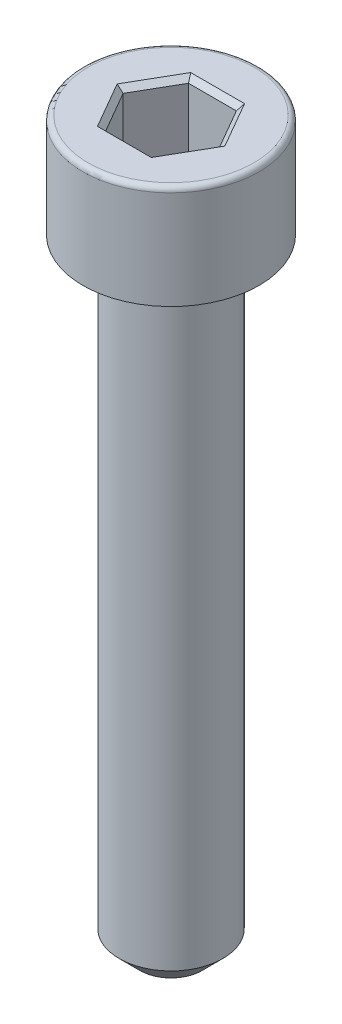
ISO-10303-21;
HEADER;
FILE_DESCRIPTION(('STEP AP214'),'2;1');
FILE_NAME('part.step','',(''),(''),'','','');
FILE_SCHEMA(('AUTOMOTIVE_DESIGN { 1 0 10303 214 1 1 1 1 }'));
ENDSEC;
DATA;
#1=APPLICATION_CONTEXT('core data for automotive mechanical design processes');
#2=APPLICATION_PROTOCOL_DEFINITION('international standard','automotive_design',2000,#1);
#3=PRODUCT_CONTEXT('',#1,'mechanical');
#4=PRODUCT('Part','Part','',(#3));
#5=PRODUCT_RELATED_PRODUCT_CATEGORY('part','',(#4));
#6=PRODUCT_DEFINITION_FORMATION('','',#4);
#7=PRODUCT_DEFINITION_CONTEXT('part definition',#1,'design');
#8=PRODUCT_DEFINITION('design','',#6,#7);
#9=PRODUCT_DEFINITION_SHAPE('','',#8);
#10=(LENGTH_UNIT() NAMED_UNIT(*) SI_UNIT(.MILLI.,.METRE.));
#11=(NAMED_UNIT(*) PLANE_ANGLE_UNIT() SI_UNIT($,.RADIAN.));
#12=(NAMED_UNIT(*) SI_UNIT($,.STERADIAN.) SOLID_ANGLE_UNIT());
#13=UNCERTAINTY_MEASURE_WITH_UNIT(LENGTH_MEASURE(1.E-05),#10,'distance_accuracy_value','');
#14=(GEOMETRIC_REPRESENTATION_CONTEXT(3) GLOBAL_UNCERTAINTY_ASSIGNED_CONTEXT((#13)) GLOBAL_UNIT_ASSIGNED_CONTEXT((#10,
#11,#12)) REPRESENTATION_CONTEXT('',''));
#15=CARTESIAN_POINT('',(0.,0.,0.));
#16=DIRECTION('',(0.,0.,1.));
#17=DIRECTION('',(1.,0.,0.));
#18=AXIS2_PLACEMENT_3D('',#15,#16,#17);
#19=CARTESIAN_POINT('',(32.8952994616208,38.75,7.5));
#20=DIRECTION('',(-0.612372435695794,-0.707106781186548,-0.353553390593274));
#21=DIRECTION('',(-0.5,0.,0.866025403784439));
#22=AXIS2_PLACEMENT_3D('',#19,#20,#21);
#23=PLANE('',#22);
#24=DIRECTION('',(-0.377964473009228,0.654653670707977,-0.654653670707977));
#25=VECTOR('',#24,1.);
#26=CARTESIAN_POINT('',(32.8952994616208,38.75,7.5));
#27=LINE('',#26,#25);
#28=CARTESIAN_POINT('',(32.8952994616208,38.75,7.5));
#29=VERTEX_POINT('',#28);
#30=CARTESIAN_POINT('',(32.7509618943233,39.,7.25));
#31=VERTEX_POINT('',#30);
#32=EDGE_CURVE('E24',#29,#31,#27,.T.);
#33=ORIENTED_EDGE('',*,*,#32,.T.);
#34=DIRECTION('',(0.5,0.,-0.866025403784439));
#35=VECTOR('',#34,1.);
#36=CARTESIAN_POINT('',(32.101442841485,39.,8.375));
#37=LINE('',#36,#35);
#38=CARTESIAN_POINT('',(31.4519237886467,39.,9.5));
#39=VERTEX_POINT('',#38);
#40=EDGE_CURVE('E224',#39,#31,#37,.T.);
#41=ORIENTED_EDGE('',*,*,#40,.F.);
#42=DIRECTION('',(0.755928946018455,-0.654653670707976,0.));
#43=VECTOR('',#42,1.);
#44=CARTESIAN_POINT('',(32.4004278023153,38.1785714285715,9.5));
#45=LINE('',#44,#43);
#46=CARTESIAN_POINT('',(31.7405989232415,38.75,9.5));
#47=VERTEX_POINT('',#46);
#48=EDGE_CURVE('E11',#39,#47,#45,.T.);
#49=ORIENTED_EDGE('',*,*,#48,.T.);
#50=DIRECTION('',(-0.5,0.,0.866025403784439));
#51=VECTOR('',#50,1.);
#52=CARTESIAN_POINT('',(32.8952994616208,38.75,7.5));
#53=LINE('',#52,#51);
#54=EDGE_CURVE('E255',#29,#47,#53,.T.);
#55=ORIENTED_EDGE('',*,*,#54,.F.);
#56=EDGE_LOOP('',(#33,#41,#49,#55));
#57=FACE_BOUND('',#56,.T.);
#58=ADVANCED_FACE('F16',(#57),#23,.F.);
#59=CARTESIAN_POINT('',(31.7405989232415,38.75,9.5));
#60=DIRECTION('',(-0.612372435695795,-0.707106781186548,0.353553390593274));
#61=DIRECTION('',(0.5,0.,0.866025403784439));
#62=AXIS2_PLACEMENT_3D('',#59,#60,#61);
#63=PLANE('',#62);
#64=DIRECTION('',(0.377964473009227,-0.654653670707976,-0.654653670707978));
#65=VECTOR('',#64,1.);
#66=CARTESIAN_POINT('',(32.8952994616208,38.75,11.5));
#67=LINE('',#66,#65);
#68=CARTESIAN_POINT('',(32.7509618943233,39.,11.75));
#69=VERTEX_POINT('',#68);
#70=CARTESIAN_POINT('',(32.8952994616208,38.75,11.5));
#71=VERTEX_POINT('',#70);
#72=EDGE_CURVE('E368',#69,#71,#67,.T.);
#73=ORIENTED_EDGE('',*,*,#72,.T.);
#74=DIRECTION('',(0.5,0.,0.866025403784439));
#75=VECTOR('',#74,1.);
#76=CARTESIAN_POINT('',(31.7405989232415,38.75,9.5));
#77=LINE('',#76,#75);
#78=EDGE_CURVE('E317',#47,#71,#77,.T.);
#79=ORIENTED_EDGE('',*,*,#78,.F.);
#80=ORIENTED_EDGE('',*,*,#48,.F.);
#81=DIRECTION('',(-0.5,0.,-0.866025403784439));
#82=VECTOR('',#81,1.);
#83=CARTESIAN_POINT('',(32.101442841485,39.,10.625));
#84=LINE('',#83,#82);
#85=EDGE_CURVE('E228',#69,#39,#84,.T.);
#86=ORIENTED_EDGE('',*,*,#85,.F.);
#87=EDGE_LOOP('',(#73,#79,#80,#86));
#88=FACE_BOUND('',#87,.T.);
#89=ADVANCED_FACE('F387',(#88),#63,.F.);
#90=CARTESIAN_POINT('',(35.2047005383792,38.75,7.5));
#91=DIRECTION('',(0.,-0.707106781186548,-0.707106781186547));
#92=DIRECTION('',(-1.,0.,0.));
#93=AXIS2_PLACEMENT_3D('',#90,#91,#92);
#94=PLANE('',#93);
#95=DIRECTION('',(0.377964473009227,0.654653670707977,-0.654653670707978));
#96=VECTOR('',#95,1.);
#97=CARTESIAN_POINT('',(35.2047005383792,38.75,7.5));
#98=LINE('',#97,#96);
#99=CARTESIAN_POINT('',(35.2047005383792,38.75,7.5));
#100=VERTEX_POINT('',#99);
#101=CARTESIAN_POINT('',(35.3490381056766,39.,7.25));
#102=VERTEX_POINT('',#101);
#103=EDGE_CURVE('E365',#100,#102,#98,.T.);
#104=ORIENTED_EDGE('',*,*,#103,.T.);
#105=DIRECTION('',(1.,0.,0.));
#106=VECTOR('',#105,1.);
#107=CARTESIAN_POINT('',(34.05,39.,7.25));
#108=LINE('',#107,#106);
#109=EDGE_CURVE('E201',#31,#102,#108,.T.);
#110=ORIENTED_EDGE('',*,*,#109,.F.);
#111=ORIENTED_EDGE('',*,*,#32,.F.);
#112=DIRECTION('',(-1.,0.,0.));
#113=VECTOR('',#112,1.);
#114=CARTESIAN_POINT('',(35.2047005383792,38.75,7.5));
#115=LINE('',#114,#113);
#116=EDGE_CURVE('E273',#100,#29,#115,.T.);
#117=ORIENTED_EDGE('',*,*,#116,.F.);
#118=EDGE_LOOP('',(#104,#110,#111,#117));
#119=FACE_BOUND('',#118,.T.);
#120=ADVANCED_FACE('F379',(#119),#94,.F.);
#121=CARTESIAN_POINT('',(32.8952994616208,38.75,11.5));
#122=DIRECTION('',(0.,-0.707106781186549,0.707106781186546));
#123=DIRECTION('',(1.,0.,0.));
#124=AXIS2_PLACEMENT_3D('',#121,#122,#123);
#125=PLANE('',#124);
#126=DIRECTION('',(-0.377964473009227,-0.654653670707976,-0.654653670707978));
#127=VECTOR('',#126,1.);
#128=CARTESIAN_POINT('',(35.2047005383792,38.75,11.5));
#129=LINE('',#128,#127);
#130=CARTESIAN_POINT('',(35.3490381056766,39.,11.75));
#131=VERTEX_POINT('',#130);
#132=CARTESIAN_POINT('',(35.2047005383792,38.75,11.5));
#133=VERTEX_POINT('',#132);
#134=EDGE_CURVE('E260',#131,#133,#129,.T.);
#135=ORIENTED_EDGE('',*,*,#134,.T.);
#136=DIRECTION('',(1.,0.,0.));
#137=VECTOR('',#136,1.);
#138=CARTESIAN_POINT('',(32.8952994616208,38.75,11.5));
#139=LINE('',#138,#137);
#140=EDGE_CURVE('E309',#71,#133,#139,.T.);
#141=ORIENTED_EDGE('',*,*,#140,.F.);
#142=ORIENTED_EDGE('',*,*,#72,.F.);
#143=DIRECTION('',(-1.,0.,0.));
#144=VECTOR('',#143,1.);
#145=CARTESIAN_POINT('',(34.05,39.,11.75));
#146=LINE('',#145,#144);
#147=EDGE_CURVE('E187',#131,#69,#146,.T.);
#148=ORIENTED_EDGE('',*,*,#147,.F.);
#149=EDGE_LOOP('',(#135,#141,#142,#148));
#150=FACE_BOUND('',#149,.T.);
#151=ADVANCED_FACE('F415',(#150),#125,.F.);
#152=CARTESIAN_POINT('',(36.3594010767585,38.75,9.5));
#153=DIRECTION('',(0.612372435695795,-0.707106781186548,-0.353553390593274));
#154=DIRECTION('',(-0.5,0.,-0.866025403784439));
#155=AXIS2_PLACEMENT_3D('',#152,#153,#154);
#156=PLANE('',#155);
#157=DIRECTION('',(0.755928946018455,0.654653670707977,0.));
#158=VECTOR('',#157,1.);
#159=CARTESIAN_POINT('',(36.3594010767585,38.75,9.5));
#160=LINE('',#159,#158);
#161=CARTESIAN_POINT('',(36.3594010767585,38.75,9.5));
#162=VERTEX_POINT('',#161);
#163=CARTESIAN_POINT('',(36.6480762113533,39.,9.5));
#164=VERTEX_POINT('',#163);
#165=EDGE_CURVE('E361',#162,#164,#160,.T.);
#166=ORIENTED_EDGE('',*,*,#165,.T.);
#167=DIRECTION('',(0.5,0.,0.866025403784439));
#168=VECTOR('',#167,1.);
#169=CARTESIAN_POINT('',(35.998557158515,39.,8.375));
#170=LINE('',#169,#168);
#171=EDGE_CURVE('E188',#102,#164,#170,.T.);
#172=ORIENTED_EDGE('',*,*,#171,.F.);
#173=ORIENTED_EDGE('',*,*,#103,.F.);
#174=DIRECTION('',(-0.5,0.,-0.866025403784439));
#175=VECTOR('',#174,1.);
#176=CARTESIAN_POINT('',(36.3594010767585,38.75,9.5));
#177=LINE('',#176,#175);
#178=EDGE_CURVE('E285',#162,#100,#177,.T.);
#179=ORIENTED_EDGE('',*,*,#178,.F.);
#180=EDGE_LOOP('',(#166,#172,#173,#179));
#181=FACE_BOUND('',#180,.T.);
#182=ADVANCED_FACE('F406',(#181),#156,.F.);
#183=CARTESIAN_POINT('',(35.2047005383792,38.75,11.5));
#184=DIRECTION('',(0.612372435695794,-0.707106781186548,0.353553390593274));
#185=DIRECTION('',(0.5,0.,-0.866025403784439));
#186=AXIS2_PLACEMENT_3D('',#183,#184,#185);
#187=PLANE('',#186);
#188=ORIENTED_EDGE('',*,*,#134,.F.);
#189=DIRECTION('',(-0.5,0.,0.866025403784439));
#190=VECTOR('',#189,1.);
#191=CARTESIAN_POINT('',(35.9985571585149,39.,10.625));
#192=LINE('',#191,#190);
#193=EDGE_CURVE('E185',#164,#131,#192,.T.);
#194=ORIENTED_EDGE('',*,*,#193,.F.);
#195=ORIENTED_EDGE('',*,*,#165,.F.);
#196=DIRECTION('',(0.5,0.,-0.866025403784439));
#197=VECTOR('',#196,1.);
#198=CARTESIAN_POINT('',(35.2047005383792,38.75,11.5));
#199=LINE('',#198,#197);
#200=EDGE_CURVE('E297',#133,#162,#199,.T.);
#201=ORIENTED_EDGE('',*,*,#200,.F.);
#202=EDGE_LOOP('',(#188,#194,#195,#201));
#203=FACE_BOUND('',#202,.T.);
#204=ADVANCED_FACE('F412',(#203),#187,.F.);
#205=CARTESIAN_POINT('',(34.9881941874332,35.75,7.625));
#206=DIRECTION('',(-0.5,0.,-0.866025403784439));
#207=DIRECTION('',(0.866025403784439,0.,-0.5));
#208=AXIS2_PLACEMENT_3D('',#205,#206,#207);
#209=CYLINDRICAL_SURFACE('',#208,0.25);
#210=CARTESIAN_POINT('',(36.0707259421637,35.5,9.5));
#211=CARTESIAN_POINT('',(36.2398279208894,35.5000000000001,9.5));
#212=CARTESIAN_POINT('',(36.3594010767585,35.6035533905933,9.5));
#213=CARTESIAN_POINT('',(36.3594010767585,35.75,9.5));
#214=(BOUNDED_CURVE() B_SPLINE_CURVE(3,(#210,#211,#212,#213),.UNSPECIFIED.,.F.,
.F.) B_SPLINE_CURVE_WITH_KNOTS((4,4),(1.5707963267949,3.1415926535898),
.UNSPECIFIED.) CURVE() GEOMETRIC_REPRESENTATION_ITEM() RATIONAL_B_SPLINE_CURVE((1.,
0.804737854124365,0.804737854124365,1.)) REPRESENTATION_ITEM(''));
#215=CARTESIAN_POINT('',(36.0707259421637,35.5,9.5));
#216=VERTEX_POINT('',#215);
#217=CARTESIAN_POINT('',(36.3594010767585,35.75,9.5));
#218=VERTEX_POINT('',#217);
#219=EDGE_CURVE('E130',#216,#218,#214,.T.);
#220=ORIENTED_EDGE('',*,*,#219,.T.);
#221=DIRECTION('',(0.5,0.,0.866025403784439));
#222=VECTOR('',#221,1.);
#223=CARTESIAN_POINT('',(36.3594010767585,35.75,9.5));
#224=LINE('',#223,#222);
#225=CARTESIAN_POINT('',(35.2047005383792,35.75,7.5));
#226=VERTEX_POINT('',#225);
#227=EDGE_CURVE('E289',#226,#218,#224,.T.);
#228=ORIENTED_EDGE('',*,*,#227,.F.);
#229=CARTESIAN_POINT('',(35.2047005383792,35.75,7.5));
#230=CARTESIAN_POINT('',(35.2047005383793,35.6035533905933,7.49999999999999));
#231=CARTESIAN_POINT('',(35.1449139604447,35.5,7.60355339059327));
#232=CARTESIAN_POINT('',(35.0603629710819,35.5,7.75));
#233=(BOUNDED_CURVE() B_SPLINE_CURVE(3,(#229,#230,#231,#232),.UNSPECIFIED.,.F.,
.F.) B_SPLINE_CURVE_WITH_KNOTS((4,4),(0.,1.5707963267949),
.UNSPECIFIED.) CURVE() GEOMETRIC_REPRESENTATION_ITEM() RATIONAL_B_SPLINE_CURVE((1.,
0.804737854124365,0.804737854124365,1.)) REPRESENTATION_ITEM(''));
#234=CARTESIAN_POINT('',(35.0603629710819,35.5,7.75));
#235=VERTEX_POINT('',#234);
#236=EDGE_CURVE('E140',#226,#235,#233,.T.);
#237=ORIENTED_EDGE('',*,*,#236,.T.);
#238=DIRECTION('',(-0.5,0.,-0.866025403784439));
#239=VECTOR('',#238,1.);
#240=CARTESIAN_POINT('',(34.9881941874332,35.5,7.625));
#241=LINE('',#240,#239);
#242=EDGE_CURVE('E202',#216,#235,#241,.T.);
#243=ORIENTED_EDGE('',*,*,#242,.F.);
#244=EDGE_LOOP('',(#220,#228,#237,#243));
#245=FACE_BOUND('',#244,.T.);
#246=ADVANCED_FACE('F458',(#245),#209,.F.);
#247=CARTESIAN_POINT('',(31.7405989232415,35.75,7.75));
#248=DIRECTION('',(-1.,0.,0.));
#249=DIRECTION('',(0.,0.,-1.));
#250=AXIS2_PLACEMENT_3D('',#247,#248,#249);
#251=CYLINDRICAL_SURFACE('',#250,0.25);
#252=CARTESIAN_POINT('',(32.8952994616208,35.75,7.5));
#253=CARTESIAN_POINT('',(32.8952994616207,35.6035533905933,7.5));
#254=CARTESIAN_POINT('',(32.9550860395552,35.5000000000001,7.60355339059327));
#255=CARTESIAN_POINT('',(33.0396370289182,35.5,7.75));
#256=(BOUNDED_CURVE() B_SPLINE_CURVE(3,(#252,#253,#254,#255),.UNSPECIFIED.,.F.,
.F.) B_SPLINE_CURVE_WITH_KNOTS((4,4),(0.,1.5707963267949),
.UNSPECIFIED.) CURVE() GEOMETRIC_REPRESENTATION_ITEM() RATIONAL_B_SPLINE_CURVE((1.,
0.804737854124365,0.804737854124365,1.)) REPRESENTATION_ITEM(''));
#257=CARTESIAN_POINT('',(32.8952994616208,35.75,7.5));
#258=VERTEX_POINT('',#257);
#259=CARTESIAN_POINT('',(33.0396370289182,35.5,7.75));
#260=VERTEX_POINT('',#259);
#261=EDGE_CURVE('E211',#258,#260,#256,.T.);
#262=ORIENTED_EDGE('',*,*,#261,.T.);
#263=DIRECTION('',(-1.,0.,0.));
#264=VECTOR('',#263,1.);
#265=CARTESIAN_POINT('',(31.7405989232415,35.5,7.75));
#266=LINE('',#265,#264);
#267=EDGE_CURVE('E206',#235,#260,#266,.T.);
#268=ORIENTED_EDGE('',*,*,#267,.F.);
#269=ORIENTED_EDGE('',*,*,#236,.F.);
#270=DIRECTION('',(1.,0.,0.));
#271=VECTOR('',#270,1.);
#272=CARTESIAN_POINT('',(35.2047005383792,35.75,7.5));
#273=LINE('',#272,#271);
#274=EDGE_CURVE('E277',#258,#226,#273,.T.);
#275=ORIENTED_EDGE('',*,*,#274,.F.);
#276=EDGE_LOOP('',(#262,#268,#269,#275));
#277=FACE_BOUND('',#276,.T.);
#278=ADVANCED_FACE('F461',(#277),#251,.F.);
#279=CARTESIAN_POINT('',(34.9881941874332,35.75,11.375));
#280=DIRECTION('',(0.5,0.,-0.866025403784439));
#281=DIRECTION('',(0.866025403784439,0.,0.5));
#282=AXIS2_PLACEMENT_3D('',#279,#280,#281);
#283=CYLINDRICAL_SURFACE('',#282,0.25);
#284=CARTESIAN_POINT('',(35.0603629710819,35.5,11.25));
#285=CARTESIAN_POINT('',(35.1449139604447,35.5000000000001,11.3964466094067));
#286=CARTESIAN_POINT('',(35.2047005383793,35.6035533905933,11.5));
#287=CARTESIAN_POINT('',(35.2047005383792,35.75,11.5));
#288=(BOUNDED_CURVE() B_SPLINE_CURVE(3,(#284,#285,#286,#287),.UNSPECIFIED.,.F.,
.F.) B_SPLINE_CURVE_WITH_KNOTS((4,4),(4.71238898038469,6.28318530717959),
.UNSPECIFIED.) CURVE() GEOMETRIC_REPRESENTATION_ITEM() RATIONAL_B_SPLINE_CURVE((1.,
0.804737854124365,0.804737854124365,1.)) REPRESENTATION_ITEM(''));
#289=CARTESIAN_POINT('',(35.0603629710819,35.5,11.25));
#290=VERTEX_POINT('',#289);
#291=CARTESIAN_POINT('',(35.2047005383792,35.75,11.5));
#292=VERTEX_POINT('',#291);
#293=EDGE_CURVE('E216',#290,#292,#288,.T.);
#294=ORIENTED_EDGE('',*,*,#293,.T.);
#295=DIRECTION('',(-0.5,0.,0.866025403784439));
#296=VECTOR('',#295,1.);
#297=CARTESIAN_POINT('',(35.2047005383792,35.75,11.5));
#298=LINE('',#297,#296);
#299=EDGE_CURVE('E301',#218,#292,#298,.T.);
#300=ORIENTED_EDGE('',*,*,#299,.F.);
#301=ORIENTED_EDGE('',*,*,#219,.F.);
#302=DIRECTION('',(0.5,0.,-0.866025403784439));
#303=VECTOR('',#302,1.);
#304=CARTESIAN_POINT('',(34.9881941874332,35.5,11.375));
#305=LINE('',#304,#303);
#306=EDGE_CURVE('E207',#290,#216,#305,.T.);
#307=ORIENTED_EDGE('',*,*,#306,.F.);
#308=EDGE_LOOP('',(#294,#300,#301,#307));
#309=FACE_BOUND('',#308,.T.);
#310=ADVANCED_FACE('F424',(#309),#283,.F.);
#311=CARTESIAN_POINT('',(31.9571052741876,35.75,9.625));
#312=DIRECTION('',(-0.5,0.,0.866025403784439));
#313=DIRECTION('',(0.,-1.,0.));
#314=AXIS2_PLACEMENT_3D('',#311,#312,#313);
#315=CYLINDRICAL_SURFACE('',#314,0.25);
#316=CARTESIAN_POINT('',(31.7405989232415,35.75,9.5));
#317=CARTESIAN_POINT('',(31.7405989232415,35.6035533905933,9.5));
#318=CARTESIAN_POINT('',(31.8601720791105,35.5000000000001,9.5));
#319=CARTESIAN_POINT('',(32.0292740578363,35.5,9.5));
#320=(BOUNDED_CURVE() B_SPLINE_CURVE(3,(#316,#317,#318,#319),.UNSPECIFIED.,.F.,
.F.) B_SPLINE_CURVE_WITH_KNOTS((4,4),(0.,1.5707963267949),
.UNSPECIFIED.) CURVE() GEOMETRIC_REPRESENTATION_ITEM() RATIONAL_B_SPLINE_CURVE((1.,
0.804737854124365,0.804737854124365,1.)) REPRESENTATION_ITEM(''));
#321=CARTESIAN_POINT('',(31.7405989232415,35.75,9.5));
#322=VERTEX_POINT('',#321);
#323=CARTESIAN_POINT('',(32.0292740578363,35.5,9.5));
#324=VERTEX_POINT('',#323);
#325=EDGE_CURVE('E48',#322,#324,#320,.T.);
#326=ORIENTED_EDGE('',*,*,#325,.T.);
#327=DIRECTION('',(-0.5,0.,0.866025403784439));
#328=VECTOR('',#327,1.);
#329=CARTESIAN_POINT('',(31.9571052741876,35.5,9.625));
#330=LINE('',#329,#328);
#331=EDGE_CURVE('E229',#260,#324,#330,.T.);
#332=ORIENTED_EDGE('',*,*,#331,.F.);
#333=ORIENTED_EDGE('',*,*,#261,.F.);
#334=DIRECTION('',(0.5,0.,-0.866025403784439));
#335=VECTOR('',#334,1.);
#336=CARTESIAN_POINT('',(32.8952994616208,35.75,7.5));
#337=LINE('',#336,#335);
#338=EDGE_CURVE('E190',#322,#258,#337,.T.);
#339=ORIENTED_EDGE('',*,*,#338,.F.);
#340=EDGE_LOOP('',(#326,#332,#333,#339));
#341=FACE_BOUND('',#340,.T.);
#342=ADVANCED_FACE('F439',(#341),#315,.F.);
#343=CARTESIAN_POINT('',(31.7405989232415,35.75,11.25));
#344=DIRECTION('',(1.,0.,0.));
#345=DIRECTION('',(0.,0.,1.));
#346=AXIS2_PLACEMENT_3D('',#343,#344,#345);
#347=CYLINDRICAL_SURFACE('',#346,0.25);
#348=CARTESIAN_POINT('',(33.0396370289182,35.5,11.25));
#349=CARTESIAN_POINT('',(32.9550860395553,35.5,11.3964466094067));
#350=CARTESIAN_POINT('',(32.8952994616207,35.6035533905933,11.5));
#351=CARTESIAN_POINT('',(32.8952994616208,35.75,11.5));
#352=(BOUNDED_CURVE() B_SPLINE_CURVE(3,(#348,#349,#350,#351),.UNSPECIFIED.,.F.,
.F.) B_SPLINE_CURVE_WITH_KNOTS((4,4),(4.71238898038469,6.28318530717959),
.UNSPECIFIED.) CURVE() GEOMETRIC_REPRESENTATION_ITEM() RATIONAL_B_SPLINE_CURVE((1.,
0.804737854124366,0.804737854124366,1.)) REPRESENTATION_ITEM(''));
#353=CARTESIAN_POINT('',(33.0396370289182,35.5,11.25));
#354=VERTEX_POINT('',#353);
#355=CARTESIAN_POINT('',(32.8952994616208,35.75,11.5));
#356=VERTEX_POINT('',#355);
#357=EDGE_CURVE('E35',#354,#356,#352,.T.);
#358=ORIENTED_EDGE('',*,*,#357,.T.);
#359=DIRECTION('',(-1.,0.,0.));
#360=VECTOR('',#359,1.);
#361=CARTESIAN_POINT('',(32.8952994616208,35.75,11.5));
#362=LINE('',#361,#360);
#363=EDGE_CURVE('E313',#292,#356,#362,.T.);
#364=ORIENTED_EDGE('',*,*,#363,.F.);
#365=ORIENTED_EDGE('',*,*,#293,.F.);
#366=DIRECTION('',(1.,0.,0.));
#367=VECTOR('',#366,1.);
#368=CARTESIAN_POINT('',(31.7405989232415,35.5,11.25));
#369=LINE('',#368,#367);
#370=EDGE_CURVE('E334',#354,#290,#369,.T.);
#371=ORIENTED_EDGE('',*,*,#370,.F.);
#372=EDGE_LOOP('',(#358,#364,#365,#371));
#373=FACE_BOUND('',#372,.T.);
#374=ADVANCED_FACE('F421',(#373),#347,.F.);
#375=CARTESIAN_POINT('',(31.9571052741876,35.75,9.375));
#376=DIRECTION('',(0.5,0.,0.866025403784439));
#377=DIRECTION('',(-0.866025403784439,0.,0.5));
#378=AXIS2_PLACEMENT_3D('',#375,#376,#377);
#379=CYLINDRICAL_SURFACE('',#378,0.25);
#380=ORIENTED_EDGE('',*,*,#325,.F.);
#381=DIRECTION('',(-0.5,0.,-0.866025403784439));
#382=VECTOR('',#381,1.);
#383=CARTESIAN_POINT('',(31.7405989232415,35.75,9.5));
#384=LINE('',#383,#382);
#385=EDGE_CURVE('E321',#356,#322,#384,.T.);
#386=ORIENTED_EDGE('',*,*,#385,.F.);
#387=ORIENTED_EDGE('',*,*,#357,.F.);
#388=DIRECTION('',(0.5,0.,0.866025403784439));
#389=VECTOR('',#388,1.);
#390=CARTESIAN_POINT('',(31.9571052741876,35.5,9.375));
#391=LINE('',#390,#389);
#392=EDGE_CURVE('E233',#324,#354,#391,.T.);
#393=ORIENTED_EDGE('',*,*,#392,.F.);
#394=EDGE_LOOP('',(#380,#386,#387,#393));
#395=FACE_BOUND('',#394,.T.);
#396=ADVANCED_FACE('F427',(#395),#379,.F.);
#397=CARTESIAN_POINT('',(34.05,38.75,9.5));
#398=DIRECTION('',(0.,-1.,0.));
#399=DIRECTION('',(0.5,0.,-0.866025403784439));
#400=AXIS2_PLACEMENT_3D('',#397,#398,#399);
#401=TOROIDAL_SURFACE('',#400,4.,0.25);
#402=CARTESIAN_POINT('',(34.05,39.,9.5));
#403=DIRECTION('',(0.,1.,0.));
#404=DIRECTION('',(0.5,0.,-0.866025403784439));
#405=AXIS2_PLACEMENT_3D('',#402,#403,#404);
#406=CIRCLE('',#405,4.);
#407=CARTESIAN_POINT('',(36.05,39.,6.03589838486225));
#408=VERTEX_POINT('',#407);
#409=EDGE_CURVE('E236',#408,#408,#406,.T.);
#410=ORIENTED_EDGE('',*,*,#409,.F.);
#411=EDGE_LOOP('',(#410));
#412=FACE_BOUND('',#411,.T.);
#413=CARTESIAN_POINT('',(34.05,38.75,9.5));
#414=DIRECTION('',(0.,-1.,0.));
#415=DIRECTION('',(0.5,0.,-0.866025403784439));
#416=AXIS2_PLACEMENT_3D('',#413,#414,#415);
#417=CIRCLE('',#416,4.25);
#418=CARTESIAN_POINT('',(36.175,38.75,5.81939203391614));
#419=VERTEX_POINT('',#418);
#420=EDGE_CURVE('E210',#419,#419,#417,.T.);
#421=ORIENTED_EDGE('',*,*,#420,.F.);
#422=EDGE_LOOP('',(#421));
#423=FACE_BOUND('',#422,.T.);
#424=ADVANCED_FACE('F429',(#412,#423),#401,.T.);
#425=CARTESIAN_POINT('',(34.05,4.,9.5));
#426=DIRECTION('',(0.,1.,0.));
#427=DIRECTION('',(-0.5,0.,0.866025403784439));
#428=AXIS2_PLACEMENT_3D('',#425,#426,#427);
#429=CONICAL_SURFACE('',#428,1.49999999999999,0.785398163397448);
#430=CARTESIAN_POINT('',(34.05,4.,9.5));
#431=DIRECTION('',(0.,-1.,0.));
#432=DIRECTION('',(0.5,0.,-0.866025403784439));
#433=AXIS2_PLACEMENT_3D('',#430,#431,#432);
#434=CIRCLE('',#433,1.49999999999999);
#435=CARTESIAN_POINT('',(34.8,4.,8.20096189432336));
#436=VERTEX_POINT('',#435);
#437=EDGE_CURVE('E157',#436,#436,#434,.T.);
#438=ORIENTED_EDGE('',*,*,#437,.F.);
#439=EDGE_LOOP('',(#438));
#440=FACE_BOUND('',#439,.T.);
#441=CARTESIAN_POINT('',(34.05,5.,9.5));
#442=DIRECTION('',(0.,1.,0.));
#443=DIRECTION('',(0.5,0.,-0.866025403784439));
#444=AXIS2_PLACEMENT_3D('',#441,#442,#443);
#445=CIRCLE('',#444,2.5);
#446=CARTESIAN_POINT('',(35.3,5.,7.33493649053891));
#447=VERTEX_POINT('',#446);
#448=EDGE_CURVE('E178',#447,#447,#445,.T.);
#449=ORIENTED_EDGE('',*,*,#448,.F.);
#450=EDGE_LOOP('',(#449));
#451=FACE_BOUND('',#450,.T.);
#452=ADVANCED_FACE('F436',(#440,#451),#429,.T.);
#453=CARTESIAN_POINT('',(31.7405989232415,35.5,9.5));
#454=DIRECTION('',(0.,1.,0.));
#455=DIRECTION('',(-0.866025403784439,0.,-0.5));
#456=AXIS2_PLACEMENT_3D('',#453,#454,#455);
#457=PLANE('',#456);
#458=ORIENTED_EDGE('',*,*,#306,.T.);
#459=ORIENTED_EDGE('',*,*,#242,.T.);
#460=ORIENTED_EDGE('',*,*,#267,.T.);
#461=ORIENTED_EDGE('',*,*,#331,.T.);
#462=ORIENTED_EDGE('',*,*,#392,.T.);
#463=ORIENTED_EDGE('',*,*,#370,.T.);
#464=EDGE_LOOP('',(#458,#459,#460,#461,#462,#463));
#465=FACE_BOUND('',#464,.T.);
#466=ADVANCED_FACE('F426',(#465),#457,.T.);
#467=CARTESIAN_POINT('',(31.7405989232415,35.5,9.5));
#468=DIRECTION('',(-0.866025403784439,0.,0.5));
#469=DIRECTION('',(0.5,0.,0.866025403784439));
#470=AXIS2_PLACEMENT_3D('',#467,#468,#469);
#471=PLANE('',#470);
#472=DIRECTION('',(0.,1.,0.));
#473=VECTOR('',#472,1.);
#474=CARTESIAN_POINT('',(31.7405989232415,35.5,9.5));
#475=LINE('',#474,#473);
#476=EDGE_CURVE('E195',#322,#47,#475,.T.);
#477=ORIENTED_EDGE('',*,*,#476,.T.);
#478=ORIENTED_EDGE('',*,*,#78,.T.);
#479=DIRECTION('',(0.,1.,0.));
#480=VECTOR('',#479,1.);
#481=CARTESIAN_POINT('',(32.8952994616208,35.5,11.5));
#482=LINE('',#481,#480);
#483=EDGE_CURVE('E305',#356,#71,#482,.T.);
#484=ORIENTED_EDGE('',*,*,#483,.F.);
#485=ORIENTED_EDGE('',*,*,#385,.T.);
#486=EDGE_LOOP('',(#477,#478,#484,#485));
#487=FACE_BOUND('',#486,.T.);
#488=ADVANCED_FACE('F393',(#487),#471,.F.);
#489=CARTESIAN_POINT('',(32.8952994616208,35.5,11.5));
#490=DIRECTION('',(0.,0.,1.));
#491=DIRECTION('',(0.,-1.,0.));
#492=AXIS2_PLACEMENT_3D('',#489,#490,#491);
#493=PLANE('',#492);
#494=ORIENTED_EDGE('',*,*,#483,.T.);
#495=ORIENTED_EDGE('',*,*,#140,.T.);
#496=DIRECTION('',(0.,1.,0.));
#497=VECTOR('',#496,1.);
#498=CARTESIAN_POINT('',(35.2047005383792,35.5,11.5));
#499=LINE('',#498,#497);
#500=EDGE_CURVE('E293',#292,#133,#499,.T.);
#501=ORIENTED_EDGE('',*,*,#500,.F.);
#502=ORIENTED_EDGE('',*,*,#363,.T.);
#503=EDGE_LOOP('',(#494,#495,#501,#502));
#504=FACE_BOUND('',#503,.T.);
#505=ADVANCED_FACE('F418',(#504),#493,.F.);
#506=CARTESIAN_POINT('',(35.2047005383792,35.5,11.5));
#507=DIRECTION('',(0.866025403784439,0.,0.5));
#508=DIRECTION('',(0.5,0.,-0.866025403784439));
#509=AXIS2_PLACEMENT_3D('',#506,#507,#508);
#510=PLANE('',#509);
#511=ORIENTED_EDGE('',*,*,#500,.T.);
#512=ORIENTED_EDGE('',*,*,#200,.T.);
#513=DIRECTION('',(0.,1.,0.));
#514=VECTOR('',#513,1.);
#515=CARTESIAN_POINT('',(36.3594010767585,35.5,9.5));
#516=LINE('',#515,#514);
#517=EDGE_CURVE('E281',#218,#162,#516,.T.);
#518=ORIENTED_EDGE('',*,*,#517,.F.);
#519=ORIENTED_EDGE('',*,*,#299,.T.);
#520=EDGE_LOOP('',(#511,#512,#518,#519));
#521=FACE_BOUND('',#520,.T.);
#522=ADVANCED_FACE('F423',(#521),#510,.F.);
#523=CARTESIAN_POINT('',(36.3594010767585,35.5,9.5));
#524=DIRECTION('',(0.866025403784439,0.,-0.5));
#525=DIRECTION('',(0.,1.,0.));
#526=AXIS2_PLACEMENT_3D('',#523,#524,#525);
#527=PLANE('',#526);
#528=ORIENTED_EDGE('',*,*,#517,.T.);
#529=ORIENTED_EDGE('',*,*,#178,.T.);
#530=DIRECTION('',(0.,1.,0.));
#531=VECTOR('',#530,1.);
#532=CARTESIAN_POINT('',(35.2047005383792,35.5,7.5));
#533=LINE('',#532,#531);
#534=EDGE_CURVE('E194',#226,#100,#533,.T.);
#535=ORIENTED_EDGE('',*,*,#534,.F.);
#536=ORIENTED_EDGE('',*,*,#227,.T.);
#537=EDGE_LOOP('',(#528,#529,#535,#536));
#538=FACE_BOUND('',#537,.T.);
#539=ADVANCED_FACE('F402',(#538),#527,.F.);
#540=CARTESIAN_POINT('',(35.2047005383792,35.5,7.5));
#541=DIRECTION('',(0.,0.,-1.));
#542=DIRECTION('',(0.,1.,0.));
#543=AXIS2_PLACEMENT_3D('',#540,#541,#542);
#544=PLANE('',#543);
#545=ORIENTED_EDGE('',*,*,#534,.T.);
#546=ORIENTED_EDGE('',*,*,#116,.T.);
#547=DIRECTION('',(0.,1.,0.));
#548=VECTOR('',#547,1.);
#549=CARTESIAN_POINT('',(32.8952994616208,35.5,7.5));
#550=LINE('',#549,#548);
#551=EDGE_CURVE('E223',#258,#29,#550,.T.);
#552=ORIENTED_EDGE('',*,*,#551,.F.);
#553=ORIENTED_EDGE('',*,*,#274,.T.);
#554=EDGE_LOOP('',(#545,#546,#552,#553));
#555=FACE_BOUND('',#554,.T.);
#556=ADVANCED_FACE('F398',(#555),#544,.F.);
#557=CARTESIAN_POINT('',(32.8952994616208,35.5,7.5));
#558=DIRECTION('',(-0.866025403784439,0.,-0.5));
#559=DIRECTION('',(0.,1.,0.));
#560=AXIS2_PLACEMENT_3D('',#557,#558,#559);
#561=PLANE('',#560);
#562=ORIENTED_EDGE('',*,*,#551,.T.);
#563=ORIENTED_EDGE('',*,*,#54,.T.);
#564=ORIENTED_EDGE('',*,*,#476,.F.);
#565=ORIENTED_EDGE('',*,*,#338,.T.);
#566=EDGE_LOOP('',(#562,#563,#564,#565));
#567=FACE_BOUND('',#566,.T.);
#568=ADVANCED_FACE('F395',(#567),#561,.F.);
#569=CARTESIAN_POINT('',(34.05,39.,9.5));
#570=DIRECTION('',(0.,-1.,0.));
#571=DIRECTION('',(0.5,0.,-0.866025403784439));
#572=AXIS2_PLACEMENT_3D('',#569,#570,#571);
#573=PLANE('',#572);
#574=ORIENTED_EDGE('',*,*,#85,.T.);
#575=ORIENTED_EDGE('',*,*,#40,.T.);
#576=ORIENTED_EDGE('',*,*,#109,.T.);
#577=ORIENTED_EDGE('',*,*,#171,.T.);
#578=ORIENTED_EDGE('',*,*,#193,.T.);
#579=ORIENTED_EDGE('',*,*,#147,.T.);
#580=EDGE_LOOP('',(#574,#575,#576,#577,#578,#579));
#581=FACE_BOUND('',#580,.T.);
#582=ORIENTED_EDGE('',*,*,#409,.T.);
#583=EDGE_LOOP('',(#582));
#584=FACE_BOUND('',#583,.T.);
#585=ADVANCED_FACE('F382',(#581,#584),#573,.F.);
#586=CARTESIAN_POINT('',(34.05,39.,9.5));
#587=DIRECTION('',(0.,-1.,0.));
#588=DIRECTION('',(0.5,0.,-0.866025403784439));
#589=AXIS2_PLACEMENT_3D('',#586,#587,#588);
#590=CYLINDRICAL_SURFACE('',#589,4.25);
#591=ORIENTED_EDGE('',*,*,#420,.T.);
#592=EDGE_LOOP('',(#591));
#593=FACE_BOUND('',#592,.T.);
#594=CARTESIAN_POINT('',(34.05,34.,9.5));
#595=DIRECTION('',(0.,-1.,0.));
#596=DIRECTION('',(0.5,0.,-0.866025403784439));
#597=AXIS2_PLACEMENT_3D('',#594,#595,#596);
#598=CIRCLE('',#597,4.25);
#599=CARTESIAN_POINT('',(36.175,34.,5.81939203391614));
#600=VERTEX_POINT('',#599);
#601=EDGE_CURVE('E149',#600,#600,#598,.T.);
#602=ORIENTED_EDGE('',*,*,#601,.F.);
#603=EDGE_LOOP('',(#602));
#604=FACE_BOUND('',#603,.T.);
#605=ADVANCED_FACE('F488',(#593,#604),#590,.T.);
#606=CARTESIAN_POINT('',(34.05,34.,9.5));
#607=DIRECTION('',(0.,-1.,0.));
#608=DIRECTION('',(0.5,0.,-0.866025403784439));
#609=AXIS2_PLACEMENT_3D('',#606,#607,#608);
#610=PLANE('',#609);
#611=CARTESIAN_POINT('',(34.05,34.,9.5));
#612=DIRECTION('',(0.,-1.,0.));
#613=DIRECTION('',(0.5,0.,-0.866025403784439));
#614=AXIS2_PLACEMENT_3D('',#611,#612,#613);
#615=CIRCLE('',#614,2.5);
#616=CARTESIAN_POINT('',(35.3,34.,7.3349364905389));
#617=VERTEX_POINT('',#616);
#618=EDGE_CURVE('E174',#617,#617,#615,.T.);
#619=ORIENTED_EDGE('',*,*,#618,.F.);
#620=EDGE_LOOP('',(#619));
#621=FACE_BOUND('',#620,.T.);
#622=ORIENTED_EDGE('',*,*,#601,.T.);
#623=EDGE_LOOP('',(#622));
#624=FACE_BOUND('',#623,.T.);
#625=ADVANCED_FACE('F491',(#621,#624),#610,.T.);
#626=CARTESIAN_POINT('',(34.05,4.,9.5));
#627=DIRECTION('',(0.,-1.,0.));
#628=DIRECTION('',(0.5,0.,-0.866025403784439));
#629=AXIS2_PLACEMENT_3D('',#626,#627,#628);
#630=PLANE('',#629);
#631=ORIENTED_EDGE('',*,*,#437,.T.);
#632=EDGE_LOOP('',(#631));
#633=FACE_BOUND('',#632,.T.);
#634=ADVANCED_FACE('F495',(#633),#630,.T.);
#635=CARTESIAN_POINT('',(34.05,4.,9.5));
#636=DIRECTION('',(0.,1.,0.));
#637=DIRECTION('',(-0.5,0.,0.866025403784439));
#638=AXIS2_PLACEMENT_3D('',#635,#636,#637);
#639=CYLINDRICAL_SURFACE('',#638,2.5);
#640=ORIENTED_EDGE('',*,*,#448,.T.);
#641=EDGE_LOOP('',(#640));
#642=FACE_BOUND('',#641,.T.);
#643=ORIENTED_EDGE('',*,*,#618,.T.);
#644=EDGE_LOOP('',(#643));
#645=FACE_BOUND('',#644,.T.);
#646=ADVANCED_FACE('F175',(#642,#645),#639,.T.);
#647=CLOSED_SHELL('',(#58,#89,#120,#151,#182,#204,#246,#278,#310,#342,#374,#396,#424,#452,#466,
#488,#505,#522,#539,#556,#568,#585,#605,#625,#634,#646));
#648=MANIFOLD_SOLID_BREP('B1',#647);
#649=ADVANCED_BREP_SHAPE_REPRESENTATION('',(#18,#648),#14);
#650=SHAPE_DEFINITION_REPRESENTATION(#9,#649);
ENDSEC;
END-ISO-10303-21;
